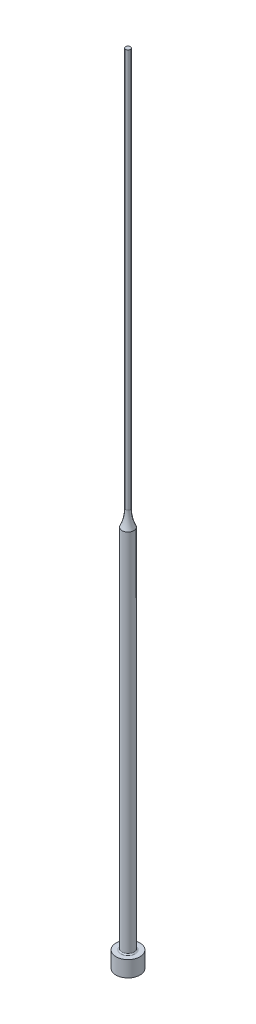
ISO-10303-21;
HEADER;
FILE_DESCRIPTION(('STEP AP214'),'2;1');
FILE_NAME('part.step','',(''),(''),'','','');
FILE_SCHEMA(('AUTOMOTIVE_DESIGN { 1 0 10303 214 1 1 1 1 }'));
ENDSEC;
DATA;
#1=APPLICATION_CONTEXT('core data for automotive mechanical design processes');
#2=APPLICATION_PROTOCOL_DEFINITION('international standard','automotive_design',2000,#1);
#3=PRODUCT_CONTEXT('',#1,'mechanical');
#4=PRODUCT('Part','Part','',(#3));
#5=PRODUCT_RELATED_PRODUCT_CATEGORY('part','',(#4));
#6=PRODUCT_DEFINITION_FORMATION('','',#4);
#7=PRODUCT_DEFINITION_CONTEXT('part definition',#1,'design');
#8=PRODUCT_DEFINITION('design','',#6,#7);
#9=PRODUCT_DEFINITION_SHAPE('','',#8);
#10=(LENGTH_UNIT() NAMED_UNIT(*) SI_UNIT(.MILLI.,.METRE.));
#11=(NAMED_UNIT(*) PLANE_ANGLE_UNIT() SI_UNIT($,.RADIAN.));
#12=(NAMED_UNIT(*) SI_UNIT($,.STERADIAN.) SOLID_ANGLE_UNIT());
#13=UNCERTAINTY_MEASURE_WITH_UNIT(LENGTH_MEASURE(1.E-05),#10,'distance_accuracy_value','');
#14=(GEOMETRIC_REPRESENTATION_CONTEXT(3) GLOBAL_UNCERTAINTY_ASSIGNED_CONTEXT((#13)) GLOBAL_UNIT_ASSIGNED_CONTEXT((#10,
#11,#12)) REPRESENTATION_CONTEXT('',''));
#15=CARTESIAN_POINT('',(0.,0.,0.));
#16=DIRECTION('',(0.,0.,1.));
#17=DIRECTION('',(1.,0.,0.));
#18=AXIS2_PLACEMENT_3D('',#15,#16,#17);
#19=CARTESIAN_POINT('',(0.600000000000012,200.,0.));
#20=DIRECTION('',(0.,-1.,0.));
#21=DIRECTION('',(1.,0.,0.));
#22=AXIS2_PLACEMENT_3D('',#19,#20,#21);
#23=PLANE('',#22);
#24=CARTESIAN_POINT('',(0.,200.,0.));
#25=DIRECTION('',(0.,1.,0.));
#26=DIRECTION('',(-1.,0.,0.));
#27=AXIS2_PLACEMENT_3D('',#24,#25,#26);
#28=CIRCLE('',#27,0.600000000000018);
#29=CARTESIAN_POINT('',(-0.600000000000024,200.,0.));
#30=VERTEX_POINT('',#29);
#31=EDGE_CURVE('E10',#30,#30,#28,.T.);
#32=ORIENTED_EDGE('',*,*,#31,.T.);
#33=EDGE_LOOP('',(#32));
#34=FACE_BOUND('',#33,.T.);
#35=ADVANCED_FACE('F30',(#34),#23,.F.);
#36=CARTESIAN_POINT('',(0.,200.,0.));
#37=DIRECTION('',(0.,1.,0.));
#38=DIRECTION('',(-1.,0.,0.));
#39=AXIS2_PLACEMENT_3D('',#36,#37,#38);
#40=CYLINDRICAL_SURFACE('',#39,0.600000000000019);
#41=ORIENTED_EDGE('',*,*,#31,.F.);
#42=EDGE_LOOP('',(#41));
#43=FACE_BOUND('',#42,.T.);
#44=CARTESIAN_POINT('',(0.,100.,0.));
#45=DIRECTION('',(0.,1.,0.));
#46=DIRECTION('',(-1.,0.,0.));
#47=AXIS2_PLACEMENT_3D('',#44,#45,#46);
#48=CIRCLE('',#47,0.60000000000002);
#49=CARTESIAN_POINT('',(-0.600000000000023,100.,0.));
#50=VERTEX_POINT('',#49);
#51=EDGE_CURVE('E36',#50,#50,#48,.T.);
#52=ORIENTED_EDGE('',*,*,#51,.T.);
#53=EDGE_LOOP('',(#52));
#54=FACE_BOUND('',#53,.T.);
#55=ADVANCED_FACE('F71',(#43,#54),#40,.T.);
#56=CARTESIAN_POINT('',(0.,100.,0.));
#57=DIRECTION('',(0.,1.,0.));
#58=DIRECTION('',(-1.,0.,0.));
#59=AXIS2_PLACEMENT_3D('',#56,#57,#58);
#60=TOROIDAL_SURFACE('',#59,10.6,10.);
#61=ORIENTED_EDGE('',*,*,#51,.F.);
#62=EDGE_LOOP('',(#61));
#63=FACE_BOUND('',#62,.T.);
#64=CARTESIAN_POINT('',(0.,95.8539175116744,0.));
#65=DIRECTION('',(0.,1.,0.));
#66=DIRECTION('',(-1.,0.,0.));
#67=AXIS2_PLACEMENT_3D('',#64,#65,#66);
#68=CIRCLE('',#67,1.50000000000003);
#69=CARTESIAN_POINT('',(-1.50000000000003,95.8539175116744,0.));
#70=VERTEX_POINT('',#69);
#71=EDGE_CURVE('E40',#70,#70,#68,.T.);
#72=ORIENTED_EDGE('',*,*,#71,.T.);
#73=EDGE_LOOP('',(#72));
#74=FACE_BOUND('',#73,.T.);
#75=ADVANCED_FACE('F75',(#63,#74),#60,.F.);
#76=CARTESIAN_POINT('',(0.,200.,0.));
#77=DIRECTION('',(0.,1.,0.));
#78=DIRECTION('',(-1.,0.,0.));
#79=AXIS2_PLACEMENT_3D('',#76,#77,#78);
#80=CYLINDRICAL_SURFACE('',#79,1.50000000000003);
#81=ORIENTED_EDGE('',*,*,#71,.F.);
#82=EDGE_LOOP('',(#81));
#83=FACE_BOUND('',#82,.T.);
#84=CARTESIAN_POINT('',(0.,4.3,0.));
#85=DIRECTION('',(0.,1.,0.));
#86=DIRECTION('',(-1.,0.,0.));
#87=AXIS2_PLACEMENT_3D('',#84,#85,#86);
#88=CIRCLE('',#87,1.50000000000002);
#89=CARTESIAN_POINT('',(-1.50000000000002,4.3,0.));
#90=VERTEX_POINT('',#89);
#91=EDGE_CURVE('E44',#90,#90,#88,.T.);
#92=ORIENTED_EDGE('',*,*,#91,.T.);
#93=EDGE_LOOP('',(#92));
#94=FACE_BOUND('',#93,.T.);
#95=ADVANCED_FACE('F80',(#83,#94),#80,.T.);
#96=CARTESIAN_POINT('',(0.,4.3,0.));
#97=DIRECTION('',(0.,1.,0.));
#98=DIRECTION('',(-1.,0.,0.));
#99=AXIS2_PLACEMENT_3D('',#96,#97,#98);
#100=TOROIDAL_SURFACE('',#99,1.80000000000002,0.3);
#101=ORIENTED_EDGE('',*,*,#91,.F.);
#102=EDGE_LOOP('',(#101));
#103=FACE_BOUND('',#102,.T.);
#104=CARTESIAN_POINT('',(0.,4.,0.));
#105=DIRECTION('',(0.,1.,0.));
#106=DIRECTION('',(-1.,0.,0.));
#107=AXIS2_PLACEMENT_3D('',#104,#105,#106);
#108=CIRCLE('',#107,1.80000000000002);
#109=CARTESIAN_POINT('',(-1.80000000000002,4.,0.));
#110=VERTEX_POINT('',#109);
#111=EDGE_CURVE('E49',#110,#110,#108,.T.);
#112=ORIENTED_EDGE('',*,*,#111,.T.);
#113=EDGE_LOOP('',(#112));
#114=FACE_BOUND('',#113,.T.);
#115=ADVANCED_FACE('F86',(#103,#114),#100,.F.);
#116=CARTESIAN_POINT('',(3.00000000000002,4.,0.));
#117=DIRECTION('',(0.,-1.,0.));
#118=DIRECTION('',(1.,0.,0.));
#119=AXIS2_PLACEMENT_3D('',#116,#117,#118);
#120=PLANE('',#119);
#121=ORIENTED_EDGE('',*,*,#111,.F.);
#122=EDGE_LOOP('',(#121));
#123=FACE_BOUND('',#122,.T.);
#124=CARTESIAN_POINT('',(0.,4.,0.));
#125=DIRECTION('',(0.,1.,0.));
#126=DIRECTION('',(-1.,0.,0.));
#127=AXIS2_PLACEMENT_3D('',#124,#125,#126);
#128=CIRCLE('',#127,3.00000000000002);
#129=CARTESIAN_POINT('',(-3.00000000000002,4.,0.));
#130=VERTEX_POINT('',#129);
#131=EDGE_CURVE('E52',#130,#130,#128,.T.);
#132=ORIENTED_EDGE('',*,*,#131,.T.);
#133=EDGE_LOOP('',(#132));
#134=FACE_BOUND('',#133,.T.);
#135=ADVANCED_FACE('F67',(#123,#134),#120,.F.);
#136=CARTESIAN_POINT('',(0.,200.,0.));
#137=DIRECTION('',(0.,1.,0.));
#138=DIRECTION('',(-1.,0.,0.));
#139=AXIS2_PLACEMENT_3D('',#136,#137,#138);
#140=CYLINDRICAL_SURFACE('',#139,3.00000000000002);
#141=ORIENTED_EDGE('',*,*,#131,.F.);
#142=EDGE_LOOP('',(#141));
#143=FACE_BOUND('',#142,.T.);
#144=CARTESIAN_POINT('',(0.,0.,0.));
#145=DIRECTION('',(0.,1.,0.));
#146=DIRECTION('',(-1.,0.,0.));
#147=AXIS2_PLACEMENT_3D('',#144,#145,#146);
#148=CIRCLE('',#147,3.00000000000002);
#149=CARTESIAN_POINT('',(-3.00000000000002,0.,0.));
#150=VERTEX_POINT('',#149);
#151=EDGE_CURVE('E55',#150,#150,#148,.T.);
#152=ORIENTED_EDGE('',*,*,#151,.T.);
#153=EDGE_LOOP('',(#152));
#154=FACE_BOUND('',#153,.T.);
#155=ADVANCED_FACE('F59',(#143,#154),#140,.T.);
#156=CARTESIAN_POINT('',(0.,0.,0.));
#157=DIRECTION('',(0.,1.,0.));
#158=DIRECTION('',(-1.,0.,0.));
#159=AXIS2_PLACEMENT_3D('',#156,#157,#158);
#160=PLANE('',#159);
#161=ORIENTED_EDGE('',*,*,#151,.F.);
#162=EDGE_LOOP('',(#161));
#163=FACE_BOUND('',#162,.T.);
#164=ADVANCED_FACE('F61',(#163),#160,.F.);
#165=CLOSED_SHELL('',(#35,#55,#75,#95,#115,#135,#155,#164));
#166=MANIFOLD_SOLID_BREP('B2',#165);
#167=ADVANCED_BREP_SHAPE_REPRESENTATION('',(#18,#166),#14);
#168=SHAPE_DEFINITION_REPRESENTATION(#9,#167);
ENDSEC;
END-ISO-10303-21;
